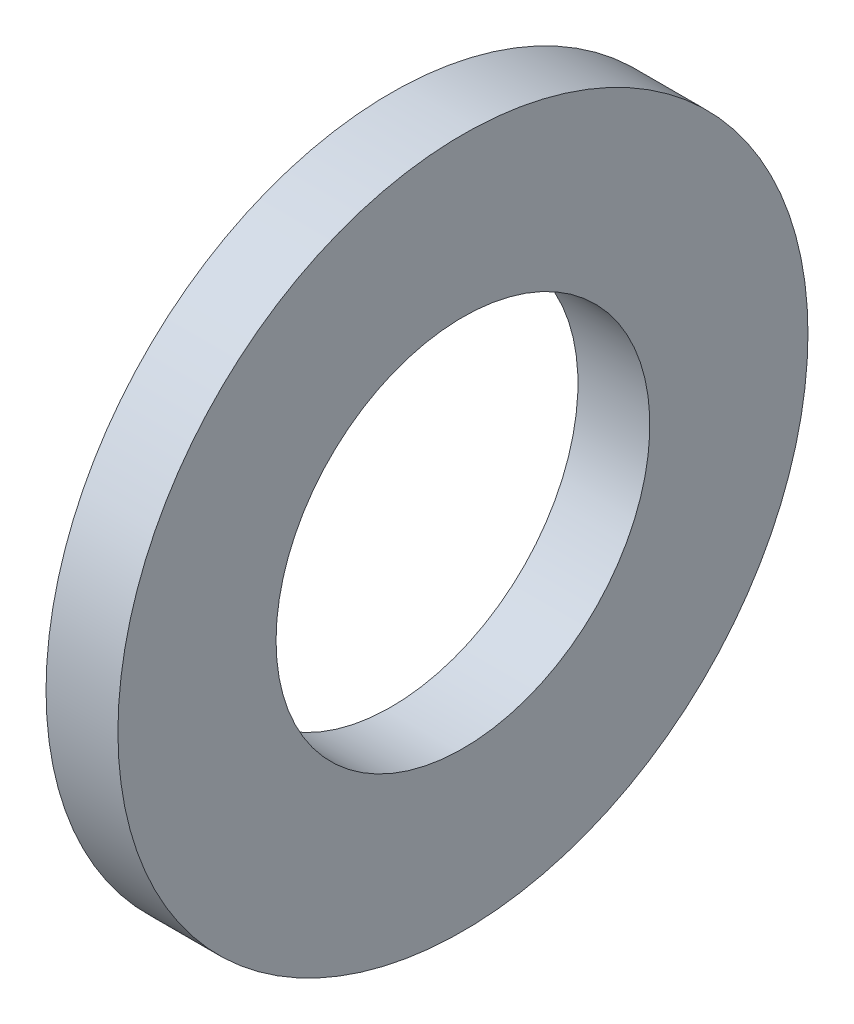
from build123d import *

# Parameters (mm, degrees)
ESQUISSE1_W = 2.5
ESQUISSE1_H = 5.5


with BuildPart() as part:
    # Esquisse1 → Base-R_volution (revolve)
    with BuildSketch(Plane(origin=(0, 0, 0), x_dir=(1, 0, 0), z_dir=(0, 1, 0)), mode=Mode.PRIVATE) as base_r_volution_sk:
        with Locations((1.25, 9.25)):
            Rectangle(ESQUISSE1_W, ESQUISSE1_H)
    revolve(base_r_volution_sk.sketch.rotate(Axis((0, 0, 0), (1, 0, 0)), 180), axis=Axis((0, 0, 0), (1, 0, 0)))


solid = part.part
